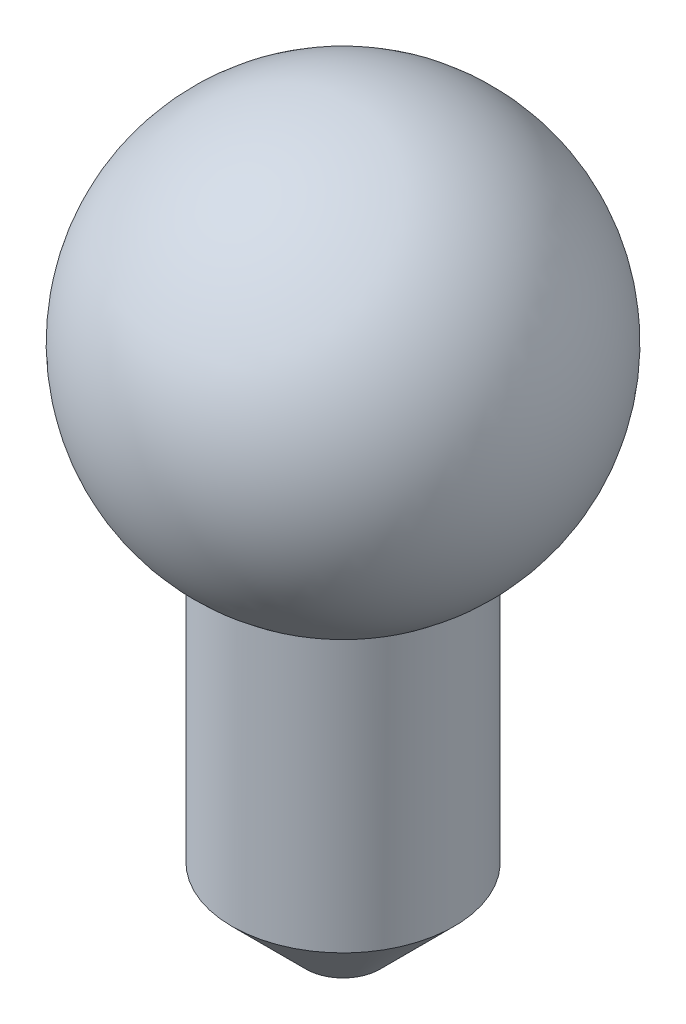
ISO-10303-21;
HEADER;
FILE_DESCRIPTION(('STEP AP214'),'2;1');
FILE_NAME('part.step','',(''),(''),'','','');
FILE_SCHEMA(('AUTOMOTIVE_DESIGN { 1 0 10303 214 1 1 1 1 }'));
ENDSEC;
DATA;
#1=APPLICATION_CONTEXT('core data for automotive mechanical design processes');
#2=APPLICATION_PROTOCOL_DEFINITION('international standard','automotive_design',2000,#1);
#3=PRODUCT_CONTEXT('',#1,'mechanical');
#4=PRODUCT('Part','Part','',(#3));
#5=PRODUCT_RELATED_PRODUCT_CATEGORY('part','',(#4));
#6=PRODUCT_DEFINITION_FORMATION('','',#4);
#7=PRODUCT_DEFINITION_CONTEXT('part definition',#1,'design');
#8=PRODUCT_DEFINITION('design','',#6,#7);
#9=PRODUCT_DEFINITION_SHAPE('','',#8);
#10=(LENGTH_UNIT() NAMED_UNIT(*) SI_UNIT(.MILLI.,.METRE.));
#11=(NAMED_UNIT(*) PLANE_ANGLE_UNIT() SI_UNIT($,.RADIAN.));
#12=(NAMED_UNIT(*) SI_UNIT($,.STERADIAN.) SOLID_ANGLE_UNIT());
#13=UNCERTAINTY_MEASURE_WITH_UNIT(LENGTH_MEASURE(1.E-05),#10,'distance_accuracy_value','');
#14=(GEOMETRIC_REPRESENTATION_CONTEXT(3) GLOBAL_UNCERTAINTY_ASSIGNED_CONTEXT((#13)) GLOBAL_UNIT_ASSIGNED_CONTEXT((#10,
#11,#12)) REPRESENTATION_CONTEXT('',''));
#15=CARTESIAN_POINT('',(0.,0.,0.));
#16=DIRECTION('',(0.,0.,1.));
#17=DIRECTION('',(1.,0.,0.));
#18=AXIS2_PLACEMENT_3D('',#15,#16,#17);
#19=CARTESIAN_POINT('',(0.,-72.4820289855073,0.));
#20=DIRECTION('',(0.,-1.,0.));
#21=DIRECTION('',(0.,0.,-1.));
#22=AXIS2_PLACEMENT_3D('',#19,#20,#21);
#23=CYLINDRICAL_SURFACE('',#22,4.5);
#24=CARTESIAN_POINT('',(0.,-11.,0.));
#25=DIRECTION('',(0.,-1.,0.));
#26=DIRECTION('',(0.,0.,-1.));
#27=AXIS2_PLACEMENT_3D('',#24,#25,#26);
#28=CIRCLE('',#27,4.5);
#29=CARTESIAN_POINT('',(0.,-11.,4.5));
#30=VERTEX_POINT('',#29);
#31=EDGE_CURVE('E39',#30,#30,#28,.T.);
#32=ORIENTED_EDGE('',*,*,#31,.F.);
#33=EDGE_LOOP('',(#32));
#34=FACE_BOUND('',#33,.T.);
#35=CARTESIAN_POINT('',(0.,0.,0.));
#36=DIRECTION('',(0.,-1.,0.));
#37=DIRECTION('',(0.,0.,-1.));
#38=AXIS2_PLACEMENT_3D('',#35,#36,#37);
#39=CIRCLE('',#38,4.5);
#40=CARTESIAN_POINT('',(0.,0.,-4.5));
#41=VERTEX_POINT('',#40);
#42=EDGE_CURVE('E10',#41,#41,#39,.T.);
#43=ORIENTED_EDGE('',*,*,#42,.T.);
#44=EDGE_LOOP('',(#43));
#45=FACE_BOUND('',#44,.T.);
#46=ADVANCED_FACE('F29',(#34,#45),#23,.T.);
#47=CARTESIAN_POINT('',(0.,7.21110255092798,0.));
#48=DIRECTION('',(0.,-1.,0.));
#49=DIRECTION('',(-1.,0.,0.));
#50=AXIS2_PLACEMENT_3D('',#47,#48,#49);
#51=SPHERICAL_SURFACE('',#50,8.5);
#52=ORIENTED_EDGE('',*,*,#42,.F.);
#53=EDGE_LOOP('',(#52));
#54=FACE_BOUND('',#53,.T.);
#55=ADVANCED_FACE('F49',(#54),#51,.T.);
#56=CARTESIAN_POINT('',(-1.49999999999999,-14.,0.));
#57=DIRECTION('',(0.,1.,0.));
#58=DIRECTION('',(0.,0.,1.));
#59=AXIS2_PLACEMENT_3D('',#56,#57,#58);
#60=PLANE('',#59);
#61=CARTESIAN_POINT('',(0.,-14.,0.));
#62=DIRECTION('',(0.,-1.,0.));
#63=DIRECTION('',(0.,0.,-1.));
#64=AXIS2_PLACEMENT_3D('',#61,#62,#63);
#65=CIRCLE('',#64,1.5);
#66=CARTESIAN_POINT('',(0.,-14.,1.5));
#67=VERTEX_POINT('',#66);
#68=EDGE_CURVE('E35',#67,#67,#65,.T.);
#69=ORIENTED_EDGE('',*,*,#68,.T.);
#70=EDGE_LOOP('',(#69));
#71=FACE_BOUND('',#70,.T.);
#72=ADVANCED_FACE('F53',(#71),#60,.F.);
#73=CARTESIAN_POINT('',(0.,-11.,0.));
#74=DIRECTION('',(0.,1.,0.));
#75=DIRECTION('',(0.,0.,1.));
#76=AXIS2_PLACEMENT_3D('',#73,#74,#75);
#77=CONICAL_SURFACE('',#76,4.5,0.785398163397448);
#78=CARTESIAN_POINT('',(0.,-14.,1.5));
#79=CARTESIAN_POINT('',(0.,-13.96875,1.53125));
#80=CARTESIAN_POINT('',(0.,-13.9375,1.5625));
#81=CARTESIAN_POINT('',(0.,-13.875,1.625));
#82=CARTESIAN_POINT('',(0.,-13.84375,1.65625));
#83=CARTESIAN_POINT('',(0.,-13.78125,1.71875));
#84=CARTESIAN_POINT('',(0.,-13.75,1.75));
#85=CARTESIAN_POINT('',(0.,-13.6875,1.8125));
#86=CARTESIAN_POINT('',(0.,-13.65625,1.84375));
#87=CARTESIAN_POINT('',(0.,-13.59375,1.90625));
#88=CARTESIAN_POINT('',(0.,-13.5625,1.9375));
#89=CARTESIAN_POINT('',(0.,-13.5,2.));
#90=CARTESIAN_POINT('',(0.,-13.46875,2.03125));
#91=CARTESIAN_POINT('',(0.,-13.40625,2.09375));
#92=CARTESIAN_POINT('',(0.,-13.375,2.125));
#93=CARTESIAN_POINT('',(0.,-13.3125,2.1875));
#94=CARTESIAN_POINT('',(0.,-13.28125,2.21875));
#95=CARTESIAN_POINT('',(0.,-13.21875,2.28125));
#96=CARTESIAN_POINT('',(0.,-13.1875,2.3125));
#97=CARTESIAN_POINT('',(0.,-13.125,2.375));
#98=CARTESIAN_POINT('',(0.,-13.09375,2.40625));
#99=CARTESIAN_POINT('',(0.,-13.03125,2.46875));
#100=CARTESIAN_POINT('',(0.,-13.,2.5));
#101=CARTESIAN_POINT('',(0.,-12.9375,2.5625));
#102=CARTESIAN_POINT('',(0.,-12.90625,2.59375));
#103=CARTESIAN_POINT('',(0.,-12.84375,2.65625));
#104=CARTESIAN_POINT('',(0.,-12.8125,2.6875));
#105=CARTESIAN_POINT('',(0.,-12.75,2.75));
#106=CARTESIAN_POINT('',(0.,-12.71875,2.78125));
#107=CARTESIAN_POINT('',(0.,-12.65625,2.84375));
#108=CARTESIAN_POINT('',(0.,-12.625,2.875));
#109=CARTESIAN_POINT('',(0.,-12.5625,2.9375));
#110=CARTESIAN_POINT('',(0.,-12.53125,2.96875));
#111=CARTESIAN_POINT('',(0.,-12.46875,3.03125));
#112=CARTESIAN_POINT('',(0.,-12.4375,3.0625));
#113=CARTESIAN_POINT('',(0.,-12.375,3.125));
#114=CARTESIAN_POINT('',(0.,-12.34375,3.15625));
#115=CARTESIAN_POINT('',(0.,-12.28125,3.21875));
#116=CARTESIAN_POINT('',(0.,-12.25,3.25));
#117=CARTESIAN_POINT('',(0.,-12.1875,3.3125));
#118=CARTESIAN_POINT('',(0.,-12.15625,3.34375));
#119=CARTESIAN_POINT('',(0.,-12.09375,3.40625));
#120=CARTESIAN_POINT('',(0.,-12.0625,3.4375));
#121=CARTESIAN_POINT('',(0.,-12.,3.5));
#122=CARTESIAN_POINT('',(0.,-11.96875,3.53125));
#123=CARTESIAN_POINT('',(0.,-11.90625,3.59375));
#124=CARTESIAN_POINT('',(0.,-11.875,3.625));
#125=CARTESIAN_POINT('',(0.,-11.8125,3.6875));
#126=CARTESIAN_POINT('',(0.,-11.78125,3.71875));
#127=CARTESIAN_POINT('',(0.,-11.71875,3.78125));
#128=CARTESIAN_POINT('',(0.,-11.6875,3.8125));
#129=CARTESIAN_POINT('',(0.,-11.625,3.875));
#130=CARTESIAN_POINT('',(0.,-11.59375,3.90625));
#131=CARTESIAN_POINT('',(0.,-11.53125,3.96875));
#132=CARTESIAN_POINT('',(0.,-11.5,4.));
#133=CARTESIAN_POINT('',(0.,-11.4375,4.0625));
#134=CARTESIAN_POINT('',(0.,-11.40625,4.09375));
#135=CARTESIAN_POINT('',(0.,-11.34375,4.15625));
#136=CARTESIAN_POINT('',(0.,-11.3125,4.1875));
#137=CARTESIAN_POINT('',(0.,-11.25,4.25));
#138=CARTESIAN_POINT('',(0.,-11.21875,4.28125));
#139=CARTESIAN_POINT('',(0.,-11.15625,4.34375));
#140=CARTESIAN_POINT('',(0.,-11.125,4.375));
#141=CARTESIAN_POINT('',(0.,-11.0625,4.4375));
#142=CARTESIAN_POINT('',(0.,-11.03125,4.46875));
#143=CARTESIAN_POINT('',(0.,-11.,4.5));
#144=B_SPLINE_CURVE_WITH_KNOTS('',3,(#78,#79,#80,#81,#82,#83,#84,#85,#86,#87,#88,#89,#90,#91,
#92,#93,#94,#95,#96,#97,#98,#99,#100,#101,#102,#103,#104,#105,#106,#107,#108,#109,#110,#111,
#112,#113,#114,#115,#116,#117,#118,#119,#120,#121,#122,#123,#124,#125,#126,#127,#128,#129,#130,
#131,#132,#133,#134,#135,#136,#137,#138,#139,#140,#141,#142,#143),.UNSPECIFIED.,.F.,.F.,(4,2,2,
2,2,2,2,2,2,2,2,2,2,2,2,2,2,2,2,2,2,2,2,2,2,2,2,2,2,2,2,2,4),(0.,0.132582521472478,
0.265165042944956,0.397747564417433,0.530330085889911,0.662912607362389,0.795495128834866,
0.928077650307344,1.06066017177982,1.1932426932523,1.32582521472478,1.45840773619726,
1.59099025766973,1.72357277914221,1.85615530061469,1.98873782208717,2.12132034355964,
2.25390286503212,2.3864853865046,2.51906790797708,2.65165042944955,2.78423295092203,
2.91681547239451,3.04939799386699,3.18198051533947,3.31456303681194,3.44714555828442,
3.5797280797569,3.71231060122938,3.84489312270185,3.97747564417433,4.11005816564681,
4.24264068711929),.UNSPECIFIED.);
#145=EDGE_CURVE('BSEAM46',#67,#30,#144,.T.);
#146=ORIENTED_EDGE('',*,*,#68,.F.);
#147=ORIENTED_EDGE('',*,*,#31,.T.);
#148=ORIENTED_EDGE('',*,*,#145,.T.);
#149=ORIENTED_EDGE('',*,*,#145,.F.);
#150=EDGE_LOOP('',(#146,#148,#147,#149));
#151=FACE_BOUND('',#150,.T.);
#152=ADVANCED_FACE('F46',(#151),#77,.T.);
#153=CLOSED_SHELL('',(#46,#55,#72,#152));
#154=MANIFOLD_SOLID_BREP('B2',#153);
#155=ADVANCED_BREP_SHAPE_REPRESENTATION('',(#18,#154),#14);
#156=SHAPE_DEFINITION_REPRESENTATION(#9,#155);
ENDSEC;
END-ISO-10303-21;
